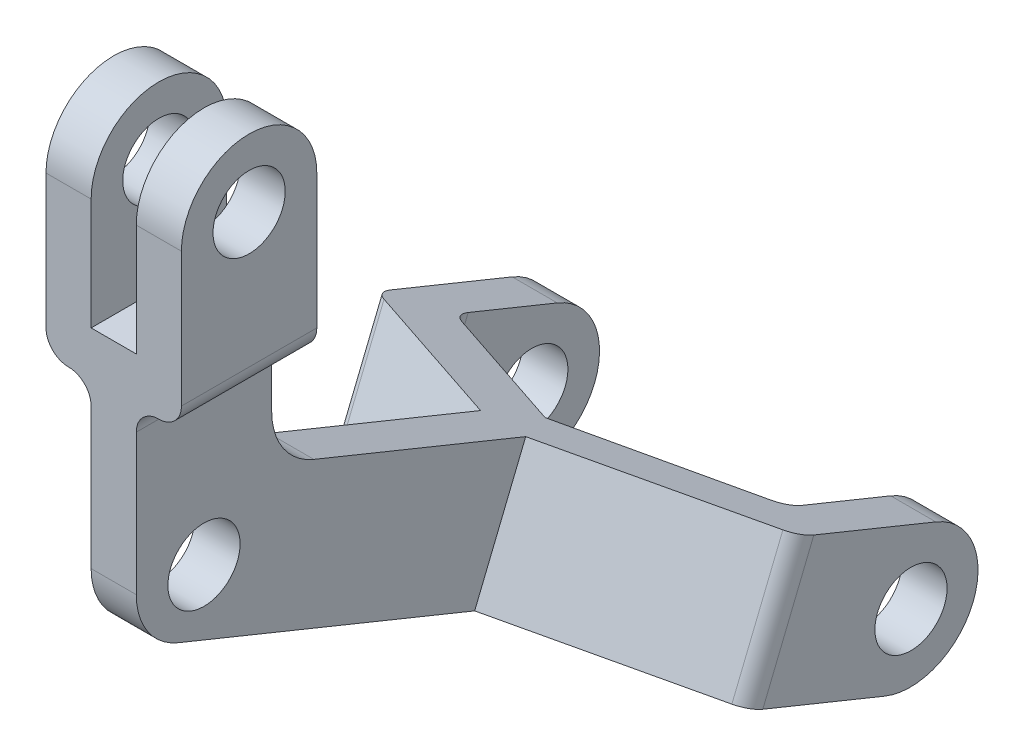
from build123d import *

# Parameters (mm, degrees)
SKETCH1_R           = 4
BOSS_EXTRUDE1_DEPTH = 5
BOSS_EXTRUDE2_DEPTH = 15
SKETCH3_R           = 7.5
SKETCH3_R_2         = 4
BOSS_EXTRUDE3_DEPTH = 5
SKETCH5_R           = 4
CUT_EXTRUDE1_DEPTH  = 5
BOSS_EXTRUDE4_START = -5
SKETCH6_R           = 7.5
BOSS_EXTRUDE4_DEPTH = 5
CUT_EXTRUDE2_START  = -5
SKETCH7_R           = 4
CUT_EXTRUDE2_DEPTH  = 5
BOSS_EXTRUDE5_DEPTH = 15
SKETCH9_R           = 7.5
BOSS_EXTRUDE6_DEPTH = 5
SKETCH10_R          = 7.5
BOSS_EXTRUDE7_DEPTH = 5
SKETCH11_R          = 4
CUT_EXTRUDE3_DEPTH  = 64


with BuildPart() as part:
    # Sketch1 → Boss-Extrude1 (new body)
    with BuildSketch(Plane(origin=(0, 0, 0), x_dir=(0, 0, -1), z_dir=(1, 0, 0))):
        with BuildLine():
            Line((15, 0), (0, 0))
            Line((0, 0), (0, -15.59))
            ThreePointArc((0, -15.59), (1.276909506, -19.776065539), (4.672838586, -22.536737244))
            Line((4.672838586, -22.536737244), (37.484806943, -35.890449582))
            Line((37.484806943, -35.890449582), (43.13912977, -21.996975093))
            Line((43.13912977, -21.996975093), (19.672838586, -12.446737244))
            ThreePointArc((19.672838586, -12.446737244), (16.276909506, -9.686065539), (15, -5.5))
            Line((15, -5.5), (15, 0))
        make_face()
        with Locations((7.5, -16.462434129)):
            Circle(SKETCH1_R, mode=Mode.SUBTRACT)
    extrude(amount=BOSS_EXTRUDE1_DEPTH)

    # Sketch2 → Boss-Extrude2 (add)
    with BuildSketch(Plane.XY):
        with BuildLine():
            Line((0, 0), (5, 0))
            ThreePointArc((5, 0), (5.732233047, 1.767766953), (7.5, 2.5))
            ThreePointArc((7.5, 2.5), (9.267766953, 3.232233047), (10, 5))
            Line((10, 5), (10, 19.86))
            Line((10, 19.86), (5, 19.86))
            Line((5, 19.86), (5, 7.5))
            Line((5, 7.5), (0, 7.5))
            Line((0, 7.5), (0, 19.86))
            Line((0, 19.86), (-5, 19.86))
            Line((-5, 19.86), (-5, 5))
            ThreePointArc((-5, 5), (-4.267766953, 3.232233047), (-2.5, 2.5))
            ThreePointArc((-2.5, 2.5), (-0.732233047, 1.767766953), (0, 0))
        make_face()
    extrude(amount=-BOSS_EXTRUDE2_DEPTH)

    # Sketch3 → Boss-Extrude3 (add)
    with BuildSketch(Plane(origin=(10, 0, 0), x_dir=(0, 0, -1), z_dir=(1, 0, 0))):
        with Locations((7.5, 19.86)):
            Circle(SKETCH3_R)
        with Locations((7.5, 19.86)):
            Circle(SKETCH3_R_2, mode=Mode.SUBTRACT)
    extrude(amount=-BOSS_EXTRUDE3_DEPTH)

    # Sketch5 → Cut-Extrude1 (cut)
    with BuildSketch(Plane(origin=(10, 0, 0), x_dir=(0, 0, -1), z_dir=(1, 0, 0))):
        with Locations(Location((7.5, 19.86, 0), (0, 0, 90))):
            Circle(SKETCH5_R)
    extrude(amount=-CUT_EXTRUDE1_DEPTH, mode=Mode.SUBTRACT)

    # Sketch6 → Boss-Extrude4 (add)
    with BuildSketch(Plane.ZY.offset(5).offset(BOSS_EXTRUDE4_START)):
        with Locations((-7.5, 19.86)):
            Circle(SKETCH6_R)
    extrude(amount=BOSS_EXTRUDE4_DEPTH)

    # Sketch7 → Cut-Extrude2 (cut)
    with BuildSketch(Plane.ZY.offset(5).offset(CUT_EXTRUDE2_START)):
        with Locations(Location((-7.5, 19.86, 0), (0, 0, 90))):
            Circle(SKETCH7_R)
    extrude(amount=CUT_EXTRUDE2_DEPTH, mode=Mode.SUBTRACT)

    # Sketch8 → Boss-Extrude5 (add)
    with BuildSketch(Plane(origin=(0, -3.809395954, 1.55033606), x_dir=(1, 0, 0), z_dir=(0, 0.926231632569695, -0.376954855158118))):
        with BuildLine():
            Line((0, 48.248693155), (5, 48.248693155))
            Line((5, 48.248693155), (24.55634321, 57.895622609))
            ThreePointArc((24.55634321, 57.895622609), (25.552769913, 58.816883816), (25.92108759, 60.122996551))
            Line((25.92108759, 60.122996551), (25.92108759, 74.712996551))
            Line((25.92108759, 74.712996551), (20.92108759, 74.712996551))
            Line((20.92108759, 74.712996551), (20.92108759, 64.128787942))
            ThreePointArc((20.92108759, 64.128787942), (20.552769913, 62.822675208), (19.55634321, 61.901414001))
            Line((19.55634321, 61.901414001), (2.258260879, 53.528693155))
            Line((2.258260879, 53.528693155), (-14.685235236, 61.886733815))
            ThreePointArc((-14.685235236, 61.886733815), (-15.702336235, 62.808740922), (-16.079254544, 64.128787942))
            Line((-16.079254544, 64.128787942), (-16.079254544, 74.791257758))
            Line((-16.079254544, 74.791257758), (-21.079254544, 74.791257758))
            Line((-21.079254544, 74.791257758), (-21.079254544, 60.201257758))
            ThreePointArc((-21.079254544, 60.201257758), (-20.702336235, 58.881210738), (-19.685235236, 57.95920363))
            Line((-19.685235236, 57.95920363), (0, 48.248693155))
        make_face()
    extrude(amount=-BOSS_EXTRUDE5_DEPTH)

    # Sketch9 → Boss-Extrude6 (add)
    with BuildSketch(Plane(origin=(25.92108759, 0, 0), x_dir=(0, 0, -1), z_dir=(1, 0, 0))):
        with Locations((64.824043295, -38.919559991)):
            Circle(SKETCH9_R)
    extrude(amount=-BOSS_EXTRUDE6_DEPTH)

    # Sketch10 → Boss-Extrude7 (add)
    with BuildSketch(Plane.ZY.offset(21.079254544)):
        with Locations((-64.896531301, -38.949060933)):
            Circle(SKETCH10_R)
    extrude(amount=-BOSS_EXTRUDE7_DEPTH)

    # Sketch11 → Cut-Extrude3 (cut)
    with BuildSketch(Plane(origin=(25.92108759, 0, 0), x_dir=(0, 0, -1), z_dir=(1, 0, 0))):
        with Locations((64.896531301, -38.949060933)):
            Circle(SKETCH11_R)
    extrude(amount=-CUT_EXTRUDE3_DEPTH, mode=Mode.SUBTRACT)


solid = part.part
